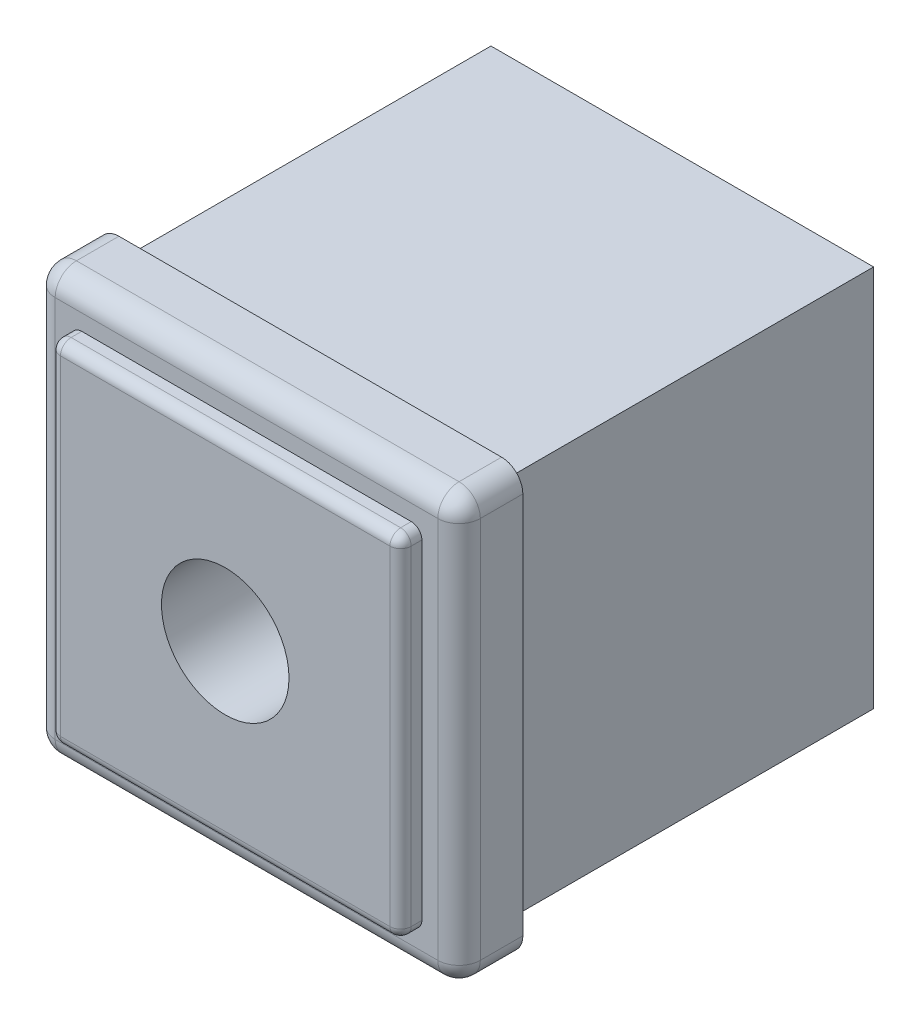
ISO-10303-21;
HEADER;
FILE_DESCRIPTION(('STEP AP214'),'2;1');
FILE_NAME('part.step','',(''),(''),'','','');
FILE_SCHEMA(('AUTOMOTIVE_DESIGN { 1 0 10303 214 1 1 1 1 }'));
ENDSEC;
DATA;
#1=APPLICATION_CONTEXT('core data for automotive mechanical design processes');
#2=APPLICATION_PROTOCOL_DEFINITION('international standard','automotive_design',2000,#1);
#3=PRODUCT_CONTEXT('',#1,'mechanical');
#4=PRODUCT('Part','Part','',(#3));
#5=PRODUCT_RELATED_PRODUCT_CATEGORY('part','',(#4));
#6=PRODUCT_DEFINITION_FORMATION('','',#4);
#7=PRODUCT_DEFINITION_CONTEXT('part definition',#1,'design');
#8=PRODUCT_DEFINITION('design','',#6,#7);
#9=PRODUCT_DEFINITION_SHAPE('','',#8);
#10=(LENGTH_UNIT() NAMED_UNIT(*) SI_UNIT(.MILLI.,.METRE.));
#11=(NAMED_UNIT(*) PLANE_ANGLE_UNIT() SI_UNIT($,.RADIAN.));
#12=(NAMED_UNIT(*) SI_UNIT($,.STERADIAN.) SOLID_ANGLE_UNIT());
#13=UNCERTAINTY_MEASURE_WITH_UNIT(LENGTH_MEASURE(1.E-05),#10,'distance_accuracy_value','');
#14=(GEOMETRIC_REPRESENTATION_CONTEXT(3) GLOBAL_UNCERTAINTY_ASSIGNED_CONTEXT((#13)) GLOBAL_UNIT_ASSIGNED_CONTEXT((#10,
#11,#12)) REPRESENTATION_CONTEXT('',''));
#15=CARTESIAN_POINT('',(0.,0.,0.));
#16=DIRECTION('',(0.,0.,1.));
#17=DIRECTION('',(1.,0.,0.));
#18=AXIS2_PLACEMENT_3D('',#15,#16,#17);
#19=CARTESIAN_POINT('',(20.,-20.,6.));
#20=DIRECTION('',(0.,0.,1.));
#21=DIRECTION('',(1.,0.,0.));
#22=AXIS2_PLACEMENT_3D('',#19,#20,#21);
#23=PLANE('',#22);
#24=DIRECTION('',(0.,1.,0.));
#25=VECTOR('',#24,1.);
#26=CARTESIAN_POINT('',(18.,18.,6.));
#27=LINE('',#26,#25);
#28=CARTESIAN_POINT('',(18.,-18.,6.));
#29=VERTEX_POINT('',#28);
#30=CARTESIAN_POINT('',(18.,18.,6.));
#31=VERTEX_POINT('',#30);
#32=EDGE_CURVE('E344',#29,#31,#27,.T.);
#33=ORIENTED_EDGE('',*,*,#32,.T.);
#34=DIRECTION('',(-1.,0.,0.));
#35=VECTOR('',#34,1.);
#36=CARTESIAN_POINT('',(-18.,18.,6.));
#37=LINE('',#36,#35);
#38=CARTESIAN_POINT('',(-18.,18.,6.));
#39=VERTEX_POINT('',#38);
#40=EDGE_CURVE('E348',#31,#39,#37,.T.);
#41=ORIENTED_EDGE('',*,*,#40,.T.);
#42=DIRECTION('',(0.,-1.,0.));
#43=VECTOR('',#42,1.);
#44=CARTESIAN_POINT('',(-18.,-18.,6.));
#45=LINE('',#44,#43);
#46=CARTESIAN_POINT('',(-18.,-18.,6.));
#47=VERTEX_POINT('',#46);
#48=EDGE_CURVE('E346',#39,#47,#45,.T.);
#49=ORIENTED_EDGE('',*,*,#48,.T.);
#50=DIRECTION('',(1.,0.,0.));
#51=VECTOR('',#50,1.);
#52=CARTESIAN_POINT('',(18.,-18.,6.));
#53=LINE('',#52,#51);
#54=EDGE_CURVE('E342',#47,#29,#53,.T.);
#55=ORIENTED_EDGE('',*,*,#54,.T.);
#56=EDGE_LOOP('',(#33,#41,#49,#55));
#57=FACE_BOUND('',#56,.T.);
#58=DIRECTION('',(1.,0.,0.));
#59=VECTOR('',#58,1.);
#60=CARTESIAN_POINT('',(-16.5,-16.5,6.));
#61=LINE('',#60,#59);
#62=CARTESIAN_POINT('',(-15.5,-16.5,6.));
#63=VERTEX_POINT('',#62);
#64=CARTESIAN_POINT('',(15.5,-16.5,6.));
#65=VERTEX_POINT('',#64);
#66=EDGE_CURVE('E266',#63,#65,#61,.T.);
#67=ORIENTED_EDGE('',*,*,#66,.F.);
#68=CARTESIAN_POINT('',(-15.5,-15.5,6.));
#69=DIRECTION('',(0.,0.,1.));
#70=DIRECTION('',(1.,0.,0.));
#71=AXIS2_PLACEMENT_3D('',#68,#69,#70);
#72=CIRCLE('',#71,1.);
#73=CARTESIAN_POINT('',(-16.5,-15.5,6.));
#74=VERTEX_POINT('',#73);
#75=EDGE_CURVE('E338',#63,#74,#72,.F.);
#76=ORIENTED_EDGE('',*,*,#75,.T.);
#77=DIRECTION('',(0.,-1.,0.));
#78=VECTOR('',#77,1.);
#79=CARTESIAN_POINT('',(-16.5,16.5,6.));
#80=LINE('',#79,#78);
#81=CARTESIAN_POINT('',(-16.5,15.5,6.));
#82=VERTEX_POINT('',#81);
#83=EDGE_CURVE('E263',#82,#74,#80,.T.);
#84=ORIENTED_EDGE('',*,*,#83,.F.);
#85=CARTESIAN_POINT('',(-15.5,15.5,6.));
#86=DIRECTION('',(0.,0.,1.));
#87=DIRECTION('',(1.,0.,0.));
#88=AXIS2_PLACEMENT_3D('',#85,#86,#87);
#89=CIRCLE('',#88,1.);
#90=CARTESIAN_POINT('',(-15.5,16.5,6.));
#91=VERTEX_POINT('',#90);
#92=EDGE_CURVE('E334',#82,#91,#89,.F.);
#93=ORIENTED_EDGE('',*,*,#92,.T.);
#94=DIRECTION('',(-1.,0.,0.));
#95=VECTOR('',#94,1.);
#96=CARTESIAN_POINT('',(-16.5,16.5,6.));
#97=LINE('',#96,#95);
#98=CARTESIAN_POINT('',(15.5,16.5,6.));
#99=VERTEX_POINT('',#98);
#100=EDGE_CURVE('E272',#99,#91,#97,.T.);
#101=ORIENTED_EDGE('',*,*,#100,.F.);
#102=CARTESIAN_POINT('',(15.5,15.5,6.));
#103=DIRECTION('',(0.,0.,1.));
#104=DIRECTION('',(1.,0.,0.));
#105=AXIS2_PLACEMENT_3D('',#102,#103,#104);
#106=CIRCLE('',#105,1.);
#107=CARTESIAN_POINT('',(16.5,15.5,6.));
#108=VERTEX_POINT('',#107);
#109=EDGE_CURVE('E336',#99,#108,#106,.F.);
#110=ORIENTED_EDGE('',*,*,#109,.T.);
#111=DIRECTION('',(0.,1.,0.));
#112=VECTOR('',#111,1.);
#113=CARTESIAN_POINT('',(16.5,16.5,6.));
#114=LINE('',#113,#112);
#115=CARTESIAN_POINT('',(16.5,-15.5,6.));
#116=VERTEX_POINT('',#115);
#117=EDGE_CURVE('E269',#116,#108,#114,.T.);
#118=ORIENTED_EDGE('',*,*,#117,.F.);
#119=CARTESIAN_POINT('',(15.5,-15.5,6.));
#120=DIRECTION('',(0.,0.,1.));
#121=DIRECTION('',(1.,0.,0.));
#122=AXIS2_PLACEMENT_3D('',#119,#120,#121);
#123=CIRCLE('',#122,1.);
#124=EDGE_CURVE('E340',#116,#65,#123,.F.);
#125=ORIENTED_EDGE('',*,*,#124,.T.);
#126=EDGE_LOOP('',(#67,#76,#84,#93,#101,#110,#118,#125));
#127=FACE_BOUND('',#126,.T.);
#128=ADVANCED_FACE('F14',(#57,#127),#23,.T.);
#129=CARTESIAN_POINT('',(-18.25,18.25,-35.));
#130=DIRECTION('',(0.,0.,1.));
#131=DIRECTION('',(1.,0.,0.));
#132=AXIS2_PLACEMENT_3D('',#129,#130,#131);
#133=PLANE('',#132);
#134=DIRECTION('',(0.,1.,0.));
#135=VECTOR('',#134,1.);
#136=CARTESIAN_POINT('',(-18.,-18.,-35.));
#137=LINE('',#136,#135);
#138=CARTESIAN_POINT('',(-18.,-18.,-35.));
#139=VERTEX_POINT('',#138);
#140=CARTESIAN_POINT('',(-18.,18.,-35.));
#141=VERTEX_POINT('',#140);
#142=EDGE_CURVE('E195',#139,#141,#137,.T.);
#143=ORIENTED_EDGE('',*,*,#142,.T.);
#144=DIRECTION('',(1.,0.,0.));
#145=VECTOR('',#144,1.);
#146=CARTESIAN_POINT('',(-18.,18.,-35.));
#147=LINE('',#146,#145);
#148=CARTESIAN_POINT('',(18.,18.,-35.));
#149=VERTEX_POINT('',#148);
#150=EDGE_CURVE('E29',#141,#149,#147,.T.);
#151=ORIENTED_EDGE('',*,*,#150,.T.);
#152=DIRECTION('',(0.,-1.,0.));
#153=VECTOR('',#152,1.);
#154=CARTESIAN_POINT('',(18.,18.,-35.));
#155=LINE('',#154,#153);
#156=CARTESIAN_POINT('',(18.,-18.,-35.));
#157=VERTEX_POINT('',#156);
#158=EDGE_CURVE('E185',#149,#157,#155,.T.);
#159=ORIENTED_EDGE('',*,*,#158,.T.);
#160=DIRECTION('',(-1.,0.,0.));
#161=VECTOR('',#160,1.);
#162=CARTESIAN_POINT('',(18.,-18.,-35.));
#163=LINE('',#162,#161);
#164=EDGE_CURVE('E190',#157,#139,#163,.T.);
#165=ORIENTED_EDGE('',*,*,#164,.T.);
#166=EDGE_LOOP('',(#143,#151,#159,#165));
#167=FACE_BOUND('',#166,.T.);
#168=CARTESIAN_POINT('',(0.,0.,-35.));
#169=DIRECTION('',(0.,0.,1.));
#170=DIRECTION('',(1.,0.,0.));
#171=AXIS2_PLACEMENT_3D('',#168,#169,#170);
#172=CIRCLE('',#171,6.);
#173=CARTESIAN_POINT('',(6.,0.,-35.));
#174=VERTEX_POINT('',#173);
#175=EDGE_CURVE('E216',#174,#174,#172,.T.);
#176=ORIENTED_EDGE('',*,*,#175,.T.);
#177=EDGE_LOOP('',(#176));
#178=FACE_BOUND('',#177,.T.);
#179=ADVANCED_FACE('F16',(#167,#178),#133,.F.);
#180=CARTESIAN_POINT('',(20.,-20.,0.));
#181=DIRECTION('',(0.,0.,1.));
#182=DIRECTION('',(1.,0.,0.));
#183=AXIS2_PLACEMENT_3D('',#180,#181,#182);
#184=PLANE('',#183);
#185=DIRECTION('',(-1.,0.,0.));
#186=VECTOR('',#185,1.);
#187=CARTESIAN_POINT('',(-20.,20.,0.));
#188=LINE('',#187,#186);
#189=CARTESIAN_POINT('',(18.,20.,0.));
#190=VERTEX_POINT('',#189);
#191=CARTESIAN_POINT('',(-18.,20.,0.));
#192=VERTEX_POINT('',#191);
#193=EDGE_CURVE('E278',#190,#192,#188,.T.);
#194=ORIENTED_EDGE('',*,*,#193,.F.);
#195=CARTESIAN_POINT('',(18.,18.,0.));
#196=DIRECTION('',(0.,0.,1.));
#197=DIRECTION('',(1.,0.,0.));
#198=AXIS2_PLACEMENT_3D('',#195,#196,#197);
#199=CIRCLE('',#198,2.);
#200=CARTESIAN_POINT('',(20.,18.,0.));
#201=VERTEX_POINT('',#200);
#202=EDGE_CURVE('E298',#190,#201,#199,.F.);
#203=ORIENTED_EDGE('',*,*,#202,.T.);
#204=DIRECTION('',(0.,1.,0.));
#205=VECTOR('',#204,1.);
#206=CARTESIAN_POINT('',(20.,20.,0.));
#207=LINE('',#206,#205);
#208=CARTESIAN_POINT('',(20.,-18.,0.));
#209=VERTEX_POINT('',#208);
#210=EDGE_CURVE('E275',#209,#201,#207,.T.);
#211=ORIENTED_EDGE('',*,*,#210,.F.);
#212=CARTESIAN_POINT('',(18.,-18.,0.));
#213=DIRECTION('',(0.,0.,1.));
#214=DIRECTION('',(1.,0.,0.));
#215=AXIS2_PLACEMENT_3D('',#212,#213,#214);
#216=CIRCLE('',#215,2.);
#217=CARTESIAN_POINT('',(18.,-20.,0.));
#218=VERTEX_POINT('',#217);
#219=EDGE_CURVE('E294',#209,#218,#216,.F.);
#220=ORIENTED_EDGE('',*,*,#219,.T.);
#221=DIRECTION('',(1.,0.,0.));
#222=VECTOR('',#221,1.);
#223=CARTESIAN_POINT('',(-20.,-20.,0.));
#224=LINE('',#223,#222);
#225=CARTESIAN_POINT('',(-18.,-20.,0.));
#226=VERTEX_POINT('',#225);
#227=EDGE_CURVE('E284',#226,#218,#224,.T.);
#228=ORIENTED_EDGE('',*,*,#227,.F.);
#229=CARTESIAN_POINT('',(-18.,-18.,0.));
#230=DIRECTION('',(0.,0.,1.));
#231=DIRECTION('',(1.,0.,0.));
#232=AXIS2_PLACEMENT_3D('',#229,#230,#231);
#233=CIRCLE('',#232,2.);
#234=CARTESIAN_POINT('',(-20.,-18.,0.));
#235=VERTEX_POINT('',#234);
#236=EDGE_CURVE('E292',#226,#235,#233,.F.);
#237=ORIENTED_EDGE('',*,*,#236,.T.);
#238=DIRECTION('',(0.,-1.,0.));
#239=VECTOR('',#238,1.);
#240=CARTESIAN_POINT('',(-20.,20.,0.));
#241=LINE('',#240,#239);
#242=CARTESIAN_POINT('',(-20.,18.,0.));
#243=VERTEX_POINT('',#242);
#244=EDGE_CURVE('E281',#243,#235,#241,.T.);
#245=ORIENTED_EDGE('',*,*,#244,.F.);
#246=CARTESIAN_POINT('',(-18.,18.,0.));
#247=DIRECTION('',(0.,0.,1.));
#248=DIRECTION('',(1.,0.,0.));
#249=AXIS2_PLACEMENT_3D('',#246,#247,#248);
#250=CIRCLE('',#249,2.);
#251=EDGE_CURVE('E296',#243,#192,#250,.F.);
#252=ORIENTED_EDGE('',*,*,#251,.T.);
#253=EDGE_LOOP('',(#194,#203,#211,#220,#228,#237,#245,#252));
#254=FACE_BOUND('',#253,.T.);
#255=DIRECTION('',(1.,0.,0.));
#256=VECTOR('',#255,1.);
#257=CARTESIAN_POINT('',(-18.,18.,0.));
#258=LINE('',#257,#256);
#259=CARTESIAN_POINT('',(-18.,18.,0.));
#260=VERTEX_POINT('',#259);
#261=CARTESIAN_POINT('',(18.,18.,0.));
#262=VERTEX_POINT('',#261);
#263=EDGE_CURVE('E178',#260,#262,#258,.T.);
#264=ORIENTED_EDGE('',*,*,#263,.F.);
#265=DIRECTION('',(0.,1.,0.));
#266=VECTOR('',#265,1.);
#267=CARTESIAN_POINT('',(-18.,-18.,0.));
#268=LINE('',#267,#266);
#269=CARTESIAN_POINT('',(-18.,-18.,0.));
#270=VERTEX_POINT('',#269);
#271=EDGE_CURVE('E196',#270,#260,#268,.T.);
#272=ORIENTED_EDGE('',*,*,#271,.F.);
#273=DIRECTION('',(-1.,0.,0.));
#274=VECTOR('',#273,1.);
#275=CARTESIAN_POINT('',(18.,-18.,0.));
#276=LINE('',#275,#274);
#277=CARTESIAN_POINT('',(18.,-18.,0.));
#278=VERTEX_POINT('',#277);
#279=EDGE_CURVE('E199',#278,#270,#276,.T.);
#280=ORIENTED_EDGE('',*,*,#279,.F.);
#281=DIRECTION('',(0.,-1.,0.));
#282=VECTOR('',#281,1.);
#283=CARTESIAN_POINT('',(18.,18.,0.));
#284=LINE('',#283,#282);
#285=EDGE_CURVE('E206',#262,#278,#284,.T.);
#286=ORIENTED_EDGE('',*,*,#285,.F.);
#287=EDGE_LOOP('',(#264,#272,#280,#286));
#288=FACE_BOUND('',#287,.T.);
#289=ADVANCED_FACE('F462',(#254,#288),#184,.F.);
#290=CARTESIAN_POINT('',(20.,20.,6.));
#291=DIRECTION('',(-1.,0.,0.));
#292=DIRECTION('',(0.,-1.,0.));
#293=AXIS2_PLACEMENT_3D('',#290,#291,#292);
#294=PLANE('',#293);
#295=DIRECTION('',(0.,0.,-1.));
#296=VECTOR('',#295,1.);
#297=CARTESIAN_POINT('',(20.,18.,6.));
#298=LINE('',#297,#296);
#299=CARTESIAN_POINT('',(20.,18.,4.));
#300=VERTEX_POINT('',#299);
#301=EDGE_CURVE('E302',#201,#300,#298,.F.);
#302=ORIENTED_EDGE('',*,*,#301,.T.);
#303=DIRECTION('',(0.,1.,0.));
#304=VECTOR('',#303,1.);
#305=CARTESIAN_POINT('',(20.,-18.,4.));
#306=LINE('',#305,#304);
#307=CARTESIAN_POINT('',(20.,-18.,4.));
#308=VERTEX_POINT('',#307);
#309=EDGE_CURVE('E360',#300,#308,#306,.F.);
#310=ORIENTED_EDGE('',*,*,#309,.T.);
#311=DIRECTION('',(0.,0.,-1.));
#312=VECTOR('',#311,1.);
#313=CARTESIAN_POINT('',(20.,-18.,6.));
#314=LINE('',#313,#312);
#315=EDGE_CURVE('E300',#308,#209,#314,.T.);
#316=ORIENTED_EDGE('',*,*,#315,.T.);
#317=ORIENTED_EDGE('',*,*,#210,.T.);
#318=EDGE_LOOP('',(#302,#310,#316,#317));
#319=FACE_BOUND('',#318,.T.);
#320=ADVANCED_FACE('F476',(#319),#294,.F.);
#321=CARTESIAN_POINT('',(-20.,20.,6.));
#322=DIRECTION('',(0.,-1.,0.));
#323=DIRECTION('',(0.,0.,-1.));
#324=AXIS2_PLACEMENT_3D('',#321,#322,#323);
#325=PLANE('',#324);
#326=DIRECTION('',(0.,0.,-1.));
#327=VECTOR('',#326,1.);
#328=CARTESIAN_POINT('',(-18.,20.,6.));
#329=LINE('',#328,#327);
#330=CARTESIAN_POINT('',(-18.,20.,4.));
#331=VERTEX_POINT('',#330);
#332=EDGE_CURVE('E287',#192,#331,#329,.F.);
#333=ORIENTED_EDGE('',*,*,#332,.T.);
#334=DIRECTION('',(-1.,0.,0.));
#335=VECTOR('',#334,1.);
#336=CARTESIAN_POINT('',(18.,20.,4.));
#337=LINE('',#336,#335);
#338=CARTESIAN_POINT('',(18.,20.,4.));
#339=VERTEX_POINT('',#338);
#340=EDGE_CURVE('E351',#331,#339,#337,.F.);
#341=ORIENTED_EDGE('',*,*,#340,.T.);
#342=DIRECTION('',(0.,0.,-1.));
#343=VECTOR('',#342,1.);
#344=CARTESIAN_POINT('',(18.,20.,6.));
#345=LINE('',#344,#343);
#346=EDGE_CURVE('E290',#339,#190,#345,.T.);
#347=ORIENTED_EDGE('',*,*,#346,.T.);
#348=ORIENTED_EDGE('',*,*,#193,.T.);
#349=EDGE_LOOP('',(#333,#341,#347,#348));
#350=FACE_BOUND('',#349,.T.);
#351=ADVANCED_FACE('F473',(#350),#325,.F.);
#352=CARTESIAN_POINT('',(-20.,20.,6.));
#353=DIRECTION('',(1.,0.,0.));
#354=DIRECTION('',(0.,0.,-1.));
#355=AXIS2_PLACEMENT_3D('',#352,#353,#354);
#356=PLANE('',#355);
#357=DIRECTION('',(0.,0.,-1.));
#358=VECTOR('',#357,1.);
#359=CARTESIAN_POINT('',(-20.,-18.,6.));
#360=LINE('',#359,#358);
#361=CARTESIAN_POINT('',(-20.,-18.,4.));
#362=VERTEX_POINT('',#361);
#363=EDGE_CURVE('E305',#235,#362,#360,.F.);
#364=ORIENTED_EDGE('',*,*,#363,.T.);
#365=DIRECTION('',(0.,-1.,0.));
#366=VECTOR('',#365,1.);
#367=CARTESIAN_POINT('',(-20.,18.,4.));
#368=LINE('',#367,#366);
#369=CARTESIAN_POINT('',(-20.,18.,4.));
#370=VERTEX_POINT('',#369);
#371=EDGE_CURVE('E358',#362,#370,#368,.F.);
#372=ORIENTED_EDGE('',*,*,#371,.T.);
#373=DIRECTION('',(0.,0.,-1.));
#374=VECTOR('',#373,1.);
#375=CARTESIAN_POINT('',(-20.,18.,6.));
#376=LINE('',#375,#374);
#377=EDGE_CURVE('E308',#370,#243,#376,.T.);
#378=ORIENTED_EDGE('',*,*,#377,.T.);
#379=ORIENTED_EDGE('',*,*,#244,.T.);
#380=EDGE_LOOP('',(#364,#372,#378,#379));
#381=FACE_BOUND('',#380,.T.);
#382=ADVANCED_FACE('F469',(#381),#356,.F.);
#383=CARTESIAN_POINT('',(-20.,-20.,6.));
#384=DIRECTION('',(0.,1.,0.));
#385=DIRECTION('',(0.,0.,1.));
#386=AXIS2_PLACEMENT_3D('',#383,#384,#385);
#387=PLANE('',#386);
#388=DIRECTION('',(0.,0.,-1.));
#389=VECTOR('',#388,1.);
#390=CARTESIAN_POINT('',(18.,-20.,6.));
#391=LINE('',#390,#389);
#392=CARTESIAN_POINT('',(18.,-20.,4.));
#393=VERTEX_POINT('',#392);
#394=EDGE_CURVE('E312',#218,#393,#391,.F.);
#395=ORIENTED_EDGE('',*,*,#394,.T.);
#396=DIRECTION('',(1.,0.,0.));
#397=VECTOR('',#396,1.);
#398=CARTESIAN_POINT('',(-18.,-20.,4.));
#399=LINE('',#398,#397);
#400=CARTESIAN_POINT('',(-18.,-20.,4.));
#401=VERTEX_POINT('',#400);
#402=EDGE_CURVE('E366',#393,#401,#399,.F.);
#403=ORIENTED_EDGE('',*,*,#402,.T.);
#404=DIRECTION('',(0.,0.,-1.));
#405=VECTOR('',#404,1.);
#406=CARTESIAN_POINT('',(-18.,-20.,6.));
#407=LINE('',#406,#405);
#408=EDGE_CURVE('E310',#401,#226,#407,.T.);
#409=ORIENTED_EDGE('',*,*,#408,.T.);
#410=ORIENTED_EDGE('',*,*,#227,.T.);
#411=EDGE_LOOP('',(#395,#403,#409,#410));
#412=FACE_BOUND('',#411,.T.);
#413=ADVANCED_FACE('F466',(#412),#387,.F.);
#414=CARTESIAN_POINT('',(-16.5,16.5,8.));
#415=DIRECTION('',(1.,0.,0.));
#416=DIRECTION('',(0.,1.,0.));
#417=AXIS2_PLACEMENT_3D('',#414,#415,#416);
#418=PLANE('',#417);
#419=DIRECTION('',(0.,0.,-1.));
#420=VECTOR('',#419,1.);
#421=CARTESIAN_POINT('',(-16.5,-15.5,8.));
#422=LINE('',#421,#420);
#423=CARTESIAN_POINT('',(-16.5,-15.5,7.));
#424=VERTEX_POINT('',#423);
#425=EDGE_CURVE('E315',#74,#424,#422,.F.);
#426=ORIENTED_EDGE('',*,*,#425,.T.);
#427=DIRECTION('',(0.,-1.,0.));
#428=VECTOR('',#427,1.);
#429=CARTESIAN_POINT('',(-16.5,15.5,7.));
#430=LINE('',#429,#428);
#431=CARTESIAN_POINT('',(-16.5,15.5,7.));
#432=VERTEX_POINT('',#431);
#433=EDGE_CURVE('E377',#424,#432,#430,.F.);
#434=ORIENTED_EDGE('',*,*,#433,.T.);
#435=DIRECTION('',(0.,0.,-1.));
#436=VECTOR('',#435,1.);
#437=CARTESIAN_POINT('',(-16.5,15.5,8.));
#438=LINE('',#437,#436);
#439=EDGE_CURVE('E318',#432,#82,#438,.T.);
#440=ORIENTED_EDGE('',*,*,#439,.T.);
#441=ORIENTED_EDGE('',*,*,#83,.T.);
#442=EDGE_LOOP('',(#426,#434,#440,#441));
#443=FACE_BOUND('',#442,.T.);
#444=ADVANCED_FACE('F418',(#443),#418,.F.);
#445=CARTESIAN_POINT('',(-16.5,-16.5,8.));
#446=DIRECTION('',(0.,1.,0.));
#447=DIRECTION('',(-1.,0.,0.));
#448=AXIS2_PLACEMENT_3D('',#445,#446,#447);
#449=PLANE('',#448);
#450=DIRECTION('',(0.,0.,-1.));
#451=VECTOR('',#450,1.);
#452=CARTESIAN_POINT('',(15.5,-16.5,8.));
#453=LINE('',#452,#451);
#454=CARTESIAN_POINT('',(15.5,-16.5,7.));
#455=VERTEX_POINT('',#454);
#456=EDGE_CURVE('E329',#65,#455,#453,.F.);
#457=ORIENTED_EDGE('',*,*,#456,.T.);
#458=DIRECTION('',(1.,0.,0.));
#459=VECTOR('',#458,1.);
#460=CARTESIAN_POINT('',(-15.5,-16.5,7.));
#461=LINE('',#460,#459);
#462=CARTESIAN_POINT('',(-15.5,-16.5,7.));
#463=VERTEX_POINT('',#462);
#464=EDGE_CURVE('E384',#455,#463,#461,.F.);
#465=ORIENTED_EDGE('',*,*,#464,.T.);
#466=DIRECTION('',(0.,0.,-1.));
#467=VECTOR('',#466,1.);
#468=CARTESIAN_POINT('',(-15.5,-16.5,8.));
#469=LINE('',#468,#467);
#470=EDGE_CURVE('E332',#463,#63,#469,.T.);
#471=ORIENTED_EDGE('',*,*,#470,.T.);
#472=ORIENTED_EDGE('',*,*,#66,.T.);
#473=EDGE_LOOP('',(#457,#465,#471,#472));
#474=FACE_BOUND('',#473,.T.);
#475=ADVANCED_FACE('F399',(#474),#449,.F.);
#476=CARTESIAN_POINT('',(16.5,16.5,8.));
#477=DIRECTION('',(-1.,0.,0.));
#478=DIRECTION('',(0.,0.,1.));
#479=AXIS2_PLACEMENT_3D('',#476,#477,#478);
#480=PLANE('',#479);
#481=DIRECTION('',(0.,0.,-1.));
#482=VECTOR('',#481,1.);
#483=CARTESIAN_POINT('',(16.5,15.5,8.));
#484=LINE('',#483,#482);
#485=CARTESIAN_POINT('',(16.5,15.5,7.));
#486=VERTEX_POINT('',#485);
#487=EDGE_CURVE('E327',#108,#486,#484,.F.);
#488=ORIENTED_EDGE('',*,*,#487,.T.);
#489=DIRECTION('',(0.,1.,0.));
#490=VECTOR('',#489,1.);
#491=CARTESIAN_POINT('',(16.5,-15.5,7.));
#492=LINE('',#491,#490);
#493=CARTESIAN_POINT('',(16.5,-15.5,7.));
#494=VERTEX_POINT('',#493);
#495=EDGE_CURVE('E9',#486,#494,#492,.F.);
#496=ORIENTED_EDGE('',*,*,#495,.T.);
#497=DIRECTION('',(0.,0.,-1.));
#498=VECTOR('',#497,1.);
#499=CARTESIAN_POINT('',(16.5,-15.5,8.));
#500=LINE('',#499,#498);
#501=EDGE_CURVE('E325',#494,#116,#500,.T.);
#502=ORIENTED_EDGE('',*,*,#501,.T.);
#503=ORIENTED_EDGE('',*,*,#117,.T.);
#504=EDGE_LOOP('',(#488,#496,#502,#503));
#505=FACE_BOUND('',#504,.T.);
#506=ADVANCED_FACE('F449',(#505),#480,.F.);
#507=CARTESIAN_POINT('',(-16.5,16.5,8.));
#508=DIRECTION('',(0.,-1.,0.));
#509=DIRECTION('',(1.,0.,0.));
#510=AXIS2_PLACEMENT_3D('',#507,#508,#509);
#511=PLANE('',#510);
#512=DIRECTION('',(0.,0.,-1.));
#513=VECTOR('',#512,1.);
#514=CARTESIAN_POINT('',(-15.5,16.5,8.));
#515=LINE('',#514,#513);
#516=CARTESIAN_POINT('',(-15.5,16.5,7.));
#517=VERTEX_POINT('',#516);
#518=EDGE_CURVE('E322',#91,#517,#515,.F.);
#519=ORIENTED_EDGE('',*,*,#518,.T.);
#520=DIRECTION('',(-1.,0.,0.));
#521=VECTOR('',#520,1.);
#522=CARTESIAN_POINT('',(15.5,16.5,7.));
#523=LINE('',#522,#521);
#524=CARTESIAN_POINT('',(15.5,16.5,7.));
#525=VERTEX_POINT('',#524);
#526=EDGE_CURVE('E386',#517,#525,#523,.F.);
#527=ORIENTED_EDGE('',*,*,#526,.T.);
#528=DIRECTION('',(0.,0.,-1.));
#529=VECTOR('',#528,1.);
#530=CARTESIAN_POINT('',(15.5,16.5,8.));
#531=LINE('',#530,#529);
#532=EDGE_CURVE('E320',#525,#99,#531,.T.);
#533=ORIENTED_EDGE('',*,*,#532,.T.);
#534=ORIENTED_EDGE('',*,*,#100,.T.);
#535=EDGE_LOOP('',(#519,#527,#533,#534));
#536=FACE_BOUND('',#535,.T.);
#537=ADVANCED_FACE('F435',(#536),#511,.F.);
#538=CARTESIAN_POINT('',(-16.5,-16.5,8.));
#539=DIRECTION('',(0.,0.,1.));
#540=DIRECTION('',(1.,0.,0.));
#541=AXIS2_PLACEMENT_3D('',#538,#539,#540);
#542=PLANE('',#541);
#543=CARTESIAN_POINT('',(0.,0.,8.));
#544=DIRECTION('',(0.,0.,1.));
#545=DIRECTION('',(1.,0.,0.));
#546=AXIS2_PLACEMENT_3D('',#543,#544,#545);
#547=CIRCLE('',#546,6.);
#548=CARTESIAN_POINT('',(6.,0.,8.));
#549=VERTEX_POINT('',#548);
#550=EDGE_CURVE('E181',#549,#549,#547,.T.);
#551=ORIENTED_EDGE('',*,*,#550,.F.);
#552=EDGE_LOOP('',(#551));
#553=FACE_BOUND('',#552,.T.);
#554=DIRECTION('',(-1.,0.,0.));
#555=VECTOR('',#554,1.);
#556=CARTESIAN_POINT('',(-15.5,15.5,8.));
#557=LINE('',#556,#555);
#558=CARTESIAN_POINT('',(15.5,15.5,8.));
#559=VERTEX_POINT('',#558);
#560=CARTESIAN_POINT('',(-15.5,15.5,8.));
#561=VERTEX_POINT('',#560);
#562=EDGE_CURVE('E370',#559,#561,#557,.T.);
#563=ORIENTED_EDGE('',*,*,#562,.T.);
#564=DIRECTION('',(0.,-1.,0.));
#565=VECTOR('',#564,1.);
#566=CARTESIAN_POINT('',(-15.5,-15.5,8.));
#567=LINE('',#566,#565);
#568=CARTESIAN_POINT('',(-15.5,-15.5,8.));
#569=VERTEX_POINT('',#568);
#570=EDGE_CURVE('E374',#561,#569,#567,.T.);
#571=ORIENTED_EDGE('',*,*,#570,.T.);
#572=DIRECTION('',(1.,0.,0.));
#573=VECTOR('',#572,1.);
#574=CARTESIAN_POINT('',(15.5,-15.5,8.));
#575=LINE('',#574,#573);
#576=CARTESIAN_POINT('',(15.5,-15.5,8.));
#577=VERTEX_POINT('',#576);
#578=EDGE_CURVE('E372',#569,#577,#575,.T.);
#579=ORIENTED_EDGE('',*,*,#578,.T.);
#580=DIRECTION('',(0.,1.,0.));
#581=VECTOR('',#580,1.);
#582=CARTESIAN_POINT('',(15.5,15.5,8.));
#583=LINE('',#582,#581);
#584=EDGE_CURVE('E368',#577,#559,#583,.T.);
#585=ORIENTED_EDGE('',*,*,#584,.T.);
#586=EDGE_LOOP('',(#563,#571,#579,#585));
#587=FACE_BOUND('',#586,.T.);
#588=ADVANCED_FACE('F554',(#553,#587),#542,.T.);
#589=CARTESIAN_POINT('',(18.,18.,6.));
#590=DIRECTION('',(0.,0.,-1.));
#591=DIRECTION('',(-1.,0.,0.));
#592=AXIS2_PLACEMENT_3D('',#589,#590,#591);
#593=CYLINDRICAL_SURFACE('',#592,2.);
#594=ORIENTED_EDGE('',*,*,#346,.F.);
#595=CARTESIAN_POINT('',(18.,18.,4.));
#596=DIRECTION('',(0.,0.,-1.));
#597=DIRECTION('',(-1.,0.,0.));
#598=AXIS2_PLACEMENT_3D('',#595,#596,#597);
#599=CIRCLE('',#598,2.);
#600=EDGE_CURVE('E356',#339,#300,#599,.T.);
#601=ORIENTED_EDGE('',*,*,#600,.T.);
#602=ORIENTED_EDGE('',*,*,#301,.F.);
#603=ORIENTED_EDGE('',*,*,#202,.F.);
#604=EDGE_LOOP('',(#594,#601,#602,#603));
#605=FACE_BOUND('',#604,.T.);
#606=ADVANCED_FACE('F526',(#605),#593,.T.);
#607=CARTESIAN_POINT('',(-18.,18.,6.));
#608=DIRECTION('',(0.,0.,-1.));
#609=DIRECTION('',(-1.,0.,0.));
#610=AXIS2_PLACEMENT_3D('',#607,#608,#609);
#611=CYLINDRICAL_SURFACE('',#610,2.);
#612=ORIENTED_EDGE('',*,*,#377,.F.);
#613=CARTESIAN_POINT('',(-18.,18.,4.));
#614=DIRECTION('',(0.,0.,-1.));
#615=DIRECTION('',(-1.,0.,0.));
#616=AXIS2_PLACEMENT_3D('',#613,#614,#615);
#617=CIRCLE('',#616,2.);
#618=EDGE_CURVE('E354',#370,#331,#617,.T.);
#619=ORIENTED_EDGE('',*,*,#618,.T.);
#620=ORIENTED_EDGE('',*,*,#332,.F.);
#621=ORIENTED_EDGE('',*,*,#251,.F.);
#622=EDGE_LOOP('',(#612,#619,#620,#621));
#623=FACE_BOUND('',#622,.T.);
#624=ADVANCED_FACE('F545',(#623),#611,.T.);
#625=CARTESIAN_POINT('',(18.,-18.,6.));
#626=DIRECTION('',(0.,0.,-1.));
#627=DIRECTION('',(-1.,0.,0.));
#628=AXIS2_PLACEMENT_3D('',#625,#626,#627);
#629=CYLINDRICAL_SURFACE('',#628,2.);
#630=ORIENTED_EDGE('',*,*,#315,.F.);
#631=CARTESIAN_POINT('',(18.,-18.,4.));
#632=DIRECTION('',(0.,0.,-1.));
#633=DIRECTION('',(-1.,0.,0.));
#634=AXIS2_PLACEMENT_3D('',#631,#632,#633);
#635=CIRCLE('',#634,2.);
#636=EDGE_CURVE('E364',#308,#393,#635,.T.);
#637=ORIENTED_EDGE('',*,*,#636,.T.);
#638=ORIENTED_EDGE('',*,*,#394,.F.);
#639=ORIENTED_EDGE('',*,*,#219,.F.);
#640=EDGE_LOOP('',(#630,#637,#638,#639));
#641=FACE_BOUND('',#640,.T.);
#642=ADVANCED_FACE('F517',(#641),#629,.T.);
#643=CARTESIAN_POINT('',(-18.,-18.,6.));
#644=DIRECTION('',(0.,0.,-1.));
#645=DIRECTION('',(-1.,0.,0.));
#646=AXIS2_PLACEMENT_3D('',#643,#644,#645);
#647=CYLINDRICAL_SURFACE('',#646,2.);
#648=ORIENTED_EDGE('',*,*,#408,.F.);
#649=CARTESIAN_POINT('',(-18.,-18.,4.));
#650=DIRECTION('',(0.,0.,-1.));
#651=DIRECTION('',(-1.,0.,0.));
#652=AXIS2_PLACEMENT_3D('',#649,#650,#651);
#653=CIRCLE('',#652,2.);
#654=EDGE_CURVE('E362',#401,#362,#653,.T.);
#655=ORIENTED_EDGE('',*,*,#654,.T.);
#656=ORIENTED_EDGE('',*,*,#363,.F.);
#657=ORIENTED_EDGE('',*,*,#236,.F.);
#658=EDGE_LOOP('',(#648,#655,#656,#657));
#659=FACE_BOUND('',#658,.T.);
#660=ADVANCED_FACE('F541',(#659),#647,.T.);
#661=CARTESIAN_POINT('',(-15.5,15.5,8.));
#662=DIRECTION('',(0.,0.,-1.));
#663=DIRECTION('',(-1.,0.,0.));
#664=AXIS2_PLACEMENT_3D('',#661,#662,#663);
#665=CYLINDRICAL_SURFACE('',#664,1.);
#666=ORIENTED_EDGE('',*,*,#439,.F.);
#667=CARTESIAN_POINT('',(-15.5,15.5,7.));
#668=DIRECTION('',(0.,0.,-1.));
#669=DIRECTION('',(-1.,0.,0.));
#670=AXIS2_PLACEMENT_3D('',#667,#668,#669);
#671=CIRCLE('',#670,1.);
#672=EDGE_CURVE('E382',#432,#517,#671,.T.);
#673=ORIENTED_EDGE('',*,*,#672,.T.);
#674=ORIENTED_EDGE('',*,*,#518,.F.);
#675=ORIENTED_EDGE('',*,*,#92,.F.);
#676=EDGE_LOOP('',(#666,#673,#674,#675));
#677=FACE_BOUND('',#676,.T.);
#678=ADVANCED_FACE('F431',(#677),#665,.T.);
#679=CARTESIAN_POINT('',(15.5,15.5,8.));
#680=DIRECTION('',(0.,0.,-1.));
#681=DIRECTION('',(-1.,0.,0.));
#682=AXIS2_PLACEMENT_3D('',#679,#680,#681);
#683=CYLINDRICAL_SURFACE('',#682,1.);
#684=ORIENTED_EDGE('',*,*,#532,.F.);
#685=CARTESIAN_POINT('',(15.5,15.5,7.));
#686=DIRECTION('',(0.,0.,-1.));
#687=DIRECTION('',(-1.,0.,0.));
#688=AXIS2_PLACEMENT_3D('',#685,#686,#687);
#689=CIRCLE('',#688,1.);
#690=EDGE_CURVE('E22',#525,#486,#689,.T.);
#691=ORIENTED_EDGE('',*,*,#690,.T.);
#692=ORIENTED_EDGE('',*,*,#487,.F.);
#693=ORIENTED_EDGE('',*,*,#109,.F.);
#694=EDGE_LOOP('',(#684,#691,#692,#693));
#695=FACE_BOUND('',#694,.T.);
#696=ADVANCED_FACE('F452',(#695),#683,.T.);
#697=CARTESIAN_POINT('',(-15.5,-15.5,8.));
#698=DIRECTION('',(0.,0.,-1.));
#699=DIRECTION('',(-1.,0.,0.));
#700=AXIS2_PLACEMENT_3D('',#697,#698,#699);
#701=CYLINDRICAL_SURFACE('',#700,1.);
#702=ORIENTED_EDGE('',*,*,#470,.F.);
#703=CARTESIAN_POINT('',(-15.5,-15.5,7.));
#704=DIRECTION('',(0.,0.,-1.));
#705=DIRECTION('',(-1.,0.,0.));
#706=AXIS2_PLACEMENT_3D('',#703,#704,#705);
#707=CIRCLE('',#706,1.);
#708=EDGE_CURVE('E380',#463,#424,#707,.T.);
#709=ORIENTED_EDGE('',*,*,#708,.T.);
#710=ORIENTED_EDGE('',*,*,#425,.F.);
#711=ORIENTED_EDGE('',*,*,#75,.F.);
#712=EDGE_LOOP('',(#702,#709,#710,#711));
#713=FACE_BOUND('',#712,.T.);
#714=ADVANCED_FACE('F414',(#713),#701,.T.);
#715=CARTESIAN_POINT('',(15.5,-15.5,8.));
#716=DIRECTION('',(0.,0.,-1.));
#717=DIRECTION('',(-1.,0.,0.));
#718=AXIS2_PLACEMENT_3D('',#715,#716,#717);
#719=CYLINDRICAL_SURFACE('',#718,1.);
#720=ORIENTED_EDGE('',*,*,#501,.F.);
#721=CARTESIAN_POINT('',(15.5,-15.5,7.));
#722=DIRECTION('',(0.,0.,-1.));
#723=DIRECTION('',(-1.,0.,0.));
#724=AXIS2_PLACEMENT_3D('',#721,#722,#723);
#725=CIRCLE('',#724,1.);
#726=EDGE_CURVE('E388',#494,#455,#725,.T.);
#727=ORIENTED_EDGE('',*,*,#726,.T.);
#728=ORIENTED_EDGE('',*,*,#456,.F.);
#729=ORIENTED_EDGE('',*,*,#124,.F.);
#730=EDGE_LOOP('',(#720,#727,#728,#729));
#731=FACE_BOUND('',#730,.T.);
#732=ADVANCED_FACE('F393',(#731),#719,.T.);
#733=CARTESIAN_POINT('',(20.,-18.,4.));
#734=DIRECTION('',(-1.,0.,0.));
#735=DIRECTION('',(0.,0.,1.));
#736=AXIS2_PLACEMENT_3D('',#733,#734,#735);
#737=CYLINDRICAL_SURFACE('',#736,2.);
#738=CARTESIAN_POINT('',(-18.,-18.,4.));
#739=DIRECTION('',(-1.,0.,0.));
#740=DIRECTION('',(0.,0.,1.));
#741=AXIS2_PLACEMENT_3D('',#738,#739,#740);
#742=CIRCLE('',#741,2.);
#743=EDGE_CURVE('E257',#401,#47,#742,.T.);
#744=ORIENTED_EDGE('',*,*,#743,.F.);
#745=ORIENTED_EDGE('',*,*,#402,.F.);
#746=CARTESIAN_POINT('',(18.,-18.,4.));
#747=DIRECTION('',(1.,0.,0.));
#748=DIRECTION('',(0.,0.,-1.));
#749=AXIS2_PLACEMENT_3D('',#746,#747,#748);
#750=CIRCLE('',#749,2.);
#751=EDGE_CURVE('E260',#29,#393,#750,.T.);
#752=ORIENTED_EDGE('',*,*,#751,.F.);
#753=ORIENTED_EDGE('',*,*,#54,.F.);
#754=EDGE_LOOP('',(#744,#745,#752,#753));
#755=FACE_BOUND('',#754,.T.);
#756=ADVANCED_FACE('F511',(#755),#737,.T.);
#757=CARTESIAN_POINT('',(18.,-18.,4.));
#758=DIRECTION('',(0.,0.,1.));
#759=DIRECTION('',(1.,0.,0.));
#760=AXIS2_PLACEMENT_3D('',#757,#758,#759);
#761=SPHERICAL_SURFACE('',#760,2.);
#762=ORIENTED_EDGE('',*,*,#751,.T.);
#763=ORIENTED_EDGE('',*,*,#636,.F.);
#764=CARTESIAN_POINT('',(18.,-18.,4.));
#765=DIRECTION('',(0.,1.,0.));
#766=DIRECTION('',(0.,0.,1.));
#767=AXIS2_PLACEMENT_3D('',#764,#765,#766);
#768=CIRCLE('',#767,2.);
#769=EDGE_CURVE('E254',#29,#308,#768,.T.);
#770=ORIENTED_EDGE('',*,*,#769,.F.);
#771=EDGE_LOOP('',(#762,#763,#770));
#772=FACE_BOUND('',#771,.T.);
#773=ADVANCED_FACE('F514',(#772),#761,.T.);
#774=CARTESIAN_POINT('',(-18.,-18.,4.));
#775=DIRECTION('',(0.,0.,1.));
#776=DIRECTION('',(1.,0.,0.));
#777=AXIS2_PLACEMENT_3D('',#774,#775,#776);
#778=SPHERICAL_SURFACE('',#777,2.);
#779=ORIENTED_EDGE('',*,*,#654,.F.);
#780=ORIENTED_EDGE('',*,*,#743,.T.);
#781=CARTESIAN_POINT('',(-18.,-18.,4.));
#782=DIRECTION('',(0.,1.,0.));
#783=DIRECTION('',(-1.,0.,0.));
#784=AXIS2_PLACEMENT_3D('',#781,#782,#783);
#785=CIRCLE('',#784,2.);
#786=EDGE_CURVE('E251',#362,#47,#785,.T.);
#787=ORIENTED_EDGE('',*,*,#786,.F.);
#788=EDGE_LOOP('',(#779,#780,#787));
#789=FACE_BOUND('',#788,.T.);
#790=ADVANCED_FACE('F538',(#789),#778,.T.);
#791=CARTESIAN_POINT('',(18.,-20.,4.));
#792=DIRECTION('',(0.,-1.,0.));
#793=DIRECTION('',(1.,0.,0.));
#794=AXIS2_PLACEMENT_3D('',#791,#792,#793);
#795=CYLINDRICAL_SURFACE('',#794,2.);
#796=ORIENTED_EDGE('',*,*,#769,.T.);
#797=ORIENTED_EDGE('',*,*,#309,.F.);
#798=CARTESIAN_POINT('',(18.,18.,4.));
#799=DIRECTION('',(0.,1.,0.));
#800=DIRECTION('',(0.,0.,1.));
#801=AXIS2_PLACEMENT_3D('',#798,#799,#800);
#802=CIRCLE('',#801,2.);
#803=EDGE_CURVE('E248',#31,#300,#802,.T.);
#804=ORIENTED_EDGE('',*,*,#803,.F.);
#805=ORIENTED_EDGE('',*,*,#32,.F.);
#806=EDGE_LOOP('',(#796,#797,#804,#805));
#807=FACE_BOUND('',#806,.T.);
#808=ADVANCED_FACE('F493',(#807),#795,.T.);
#809=CARTESIAN_POINT('',(-18.,-20.,4.));
#810=DIRECTION('',(0.,1.,0.));
#811=DIRECTION('',(0.,0.,1.));
#812=AXIS2_PLACEMENT_3D('',#809,#810,#811);
#813=CYLINDRICAL_SURFACE('',#812,2.);
#814=ORIENTED_EDGE('',*,*,#786,.T.);
#815=ORIENTED_EDGE('',*,*,#48,.F.);
#816=CARTESIAN_POINT('',(-18.,18.,4.));
#817=DIRECTION('',(0.,1.,0.));
#818=DIRECTION('',(0.,0.,1.));
#819=AXIS2_PLACEMENT_3D('',#816,#817,#818);
#820=CIRCLE('',#819,2.);
#821=EDGE_CURVE('E245',#370,#39,#820,.T.);
#822=ORIENTED_EDGE('',*,*,#821,.F.);
#823=ORIENTED_EDGE('',*,*,#371,.F.);
#824=EDGE_LOOP('',(#814,#815,#822,#823));
#825=FACE_BOUND('',#824,.T.);
#826=ADVANCED_FACE('F534',(#825),#813,.T.);
#827=CARTESIAN_POINT('',(18.,18.,4.));
#828=DIRECTION('',(0.,0.,1.));
#829=DIRECTION('',(1.,0.,0.));
#830=AXIS2_PLACEMENT_3D('',#827,#828,#829);
#831=SPHERICAL_SURFACE('',#830,2.);
#832=ORIENTED_EDGE('',*,*,#803,.T.);
#833=ORIENTED_EDGE('',*,*,#600,.F.);
#834=CARTESIAN_POINT('',(18.,18.,4.));
#835=DIRECTION('',(-1.,0.,0.));
#836=DIRECTION('',(0.,0.,1.));
#837=AXIS2_PLACEMENT_3D('',#834,#835,#836);
#838=CIRCLE('',#837,2.);
#839=EDGE_CURVE('E243',#31,#339,#838,.T.);
#840=ORIENTED_EDGE('',*,*,#839,.F.);
#841=EDGE_LOOP('',(#832,#833,#840));
#842=FACE_BOUND('',#841,.T.);
#843=ADVANCED_FACE('F499',(#842),#831,.T.);
#844=CARTESIAN_POINT('',(-18.,18.,4.));
#845=DIRECTION('',(0.,0.,1.));
#846=DIRECTION('',(1.,0.,0.));
#847=AXIS2_PLACEMENT_3D('',#844,#845,#846);
#848=SPHERICAL_SURFACE('',#847,2.);
#849=ORIENTED_EDGE('',*,*,#618,.F.);
#850=ORIENTED_EDGE('',*,*,#821,.T.);
#851=CARTESIAN_POINT('',(-18.,18.,4.));
#852=DIRECTION('',(1.,0.,0.));
#853=DIRECTION('',(0.,0.,-1.));
#854=AXIS2_PLACEMENT_3D('',#851,#852,#853);
#855=CIRCLE('',#854,2.);
#856=EDGE_CURVE('E241',#331,#39,#855,.T.);
#857=ORIENTED_EDGE('',*,*,#856,.F.);
#858=EDGE_LOOP('',(#849,#850,#857));
#859=FACE_BOUND('',#858,.T.);
#860=ADVANCED_FACE('F530',(#859),#848,.T.);
#861=CARTESIAN_POINT('',(20.,18.,4.));
#862=DIRECTION('',(1.,0.,0.));
#863=DIRECTION('',(0.,0.,-1.));
#864=AXIS2_PLACEMENT_3D('',#861,#862,#863);
#865=CYLINDRICAL_SURFACE('',#864,2.);
#866=ORIENTED_EDGE('',*,*,#839,.T.);
#867=ORIENTED_EDGE('',*,*,#340,.F.);
#868=ORIENTED_EDGE('',*,*,#856,.T.);
#869=ORIENTED_EDGE('',*,*,#40,.F.);
#870=EDGE_LOOP('',(#866,#867,#868,#869));
#871=FACE_BOUND('',#870,.T.);
#872=ADVANCED_FACE('F503',(#871),#865,.T.);
#873=CARTESIAN_POINT('',(15.5,-16.5,7.));
#874=DIRECTION('',(0.,-1.,0.));
#875=DIRECTION('',(0.,0.,-1.));
#876=AXIS2_PLACEMENT_3D('',#873,#874,#875);
#877=CYLINDRICAL_SURFACE('',#876,1.);
#878=CARTESIAN_POINT('',(15.5,-15.5,7.));
#879=DIRECTION('',(0.,-1.,0.));
#880=DIRECTION('',(0.,0.,-1.));
#881=AXIS2_PLACEMENT_3D('',#878,#879,#880);
#882=CIRCLE('',#881,1.);
#883=EDGE_CURVE('E235',#494,#577,#882,.T.);
#884=ORIENTED_EDGE('',*,*,#883,.F.);
#885=ORIENTED_EDGE('',*,*,#495,.F.);
#886=CARTESIAN_POINT('',(15.5,15.5,7.));
#887=DIRECTION('',(0.,1.,0.));
#888=DIRECTION('',(0.,0.,1.));
#889=AXIS2_PLACEMENT_3D('',#886,#887,#888);
#890=CIRCLE('',#889,1.);
#891=EDGE_CURVE('E238',#559,#486,#890,.T.);
#892=ORIENTED_EDGE('',*,*,#891,.F.);
#893=ORIENTED_EDGE('',*,*,#584,.F.);
#894=EDGE_LOOP('',(#884,#885,#892,#893));
#895=FACE_BOUND('',#894,.T.);
#896=ADVANCED_FACE('F447',(#895),#877,.T.);
#897=CARTESIAN_POINT('',(15.5,15.5,7.));
#898=DIRECTION('',(0.,0.,1.));
#899=DIRECTION('',(1.,0.,0.));
#900=AXIS2_PLACEMENT_3D('',#897,#898,#899);
#901=SPHERICAL_SURFACE('',#900,1.);
#902=ORIENTED_EDGE('',*,*,#891,.T.);
#903=ORIENTED_EDGE('',*,*,#690,.F.);
#904=CARTESIAN_POINT('',(15.5,15.5,7.));
#905=DIRECTION('',(-1.,0.,0.));
#906=DIRECTION('',(0.,0.,1.));
#907=AXIS2_PLACEMENT_3D('',#904,#905,#906);
#908=CIRCLE('',#907,1.);
#909=EDGE_CURVE('E232',#559,#525,#908,.T.);
#910=ORIENTED_EDGE('',*,*,#909,.F.);
#911=EDGE_LOOP('',(#902,#903,#910));
#912=FACE_BOUND('',#911,.T.);
#913=ADVANCED_FACE('F442',(#912),#901,.T.);
#914=CARTESIAN_POINT('',(15.5,-15.5,7.));
#915=DIRECTION('',(0.,0.,1.));
#916=DIRECTION('',(1.,0.,0.));
#917=AXIS2_PLACEMENT_3D('',#914,#915,#916);
#918=SPHERICAL_SURFACE('',#917,1.);
#919=ORIENTED_EDGE('',*,*,#726,.F.);
#920=ORIENTED_EDGE('',*,*,#883,.T.);
#921=CARTESIAN_POINT('',(15.5,-15.5,7.));
#922=DIRECTION('',(-1.,0.,0.));
#923=DIRECTION('',(0.,-1.,0.));
#924=AXIS2_PLACEMENT_3D('',#921,#922,#923);
#925=CIRCLE('',#924,1.);
#926=EDGE_CURVE('E229',#455,#577,#925,.T.);
#927=ORIENTED_EDGE('',*,*,#926,.F.);
#928=EDGE_LOOP('',(#919,#920,#927));
#929=FACE_BOUND('',#928,.T.);
#930=ADVANCED_FACE('F403',(#929),#918,.T.);
#931=CARTESIAN_POINT('',(-16.5,15.5,7.));
#932=DIRECTION('',(1.,0.,0.));
#933=DIRECTION('',(0.,1.,0.));
#934=AXIS2_PLACEMENT_3D('',#931,#932,#933);
#935=CYLINDRICAL_SURFACE('',#934,1.);
#936=ORIENTED_EDGE('',*,*,#909,.T.);
#937=ORIENTED_EDGE('',*,*,#526,.F.);
#938=CARTESIAN_POINT('',(-15.5,15.5,7.));
#939=DIRECTION('',(-1.,0.,0.));
#940=DIRECTION('',(0.,0.,1.));
#941=AXIS2_PLACEMENT_3D('',#938,#939,#940);
#942=CIRCLE('',#941,1.);
#943=EDGE_CURVE('E226',#561,#517,#942,.T.);
#944=ORIENTED_EDGE('',*,*,#943,.F.);
#945=ORIENTED_EDGE('',*,*,#562,.F.);
#946=EDGE_LOOP('',(#936,#937,#944,#945));
#947=FACE_BOUND('',#946,.T.);
#948=ADVANCED_FACE('F438',(#947),#935,.T.);
#949=CARTESIAN_POINT('',(-16.5,-15.5,7.));
#950=DIRECTION('',(-1.,0.,0.));
#951=DIRECTION('',(0.,-1.,0.));
#952=AXIS2_PLACEMENT_3D('',#949,#950,#951);
#953=CYLINDRICAL_SURFACE('',#952,1.);
#954=ORIENTED_EDGE('',*,*,#926,.T.);
#955=ORIENTED_EDGE('',*,*,#578,.F.);
#956=CARTESIAN_POINT('',(-15.5,-15.5,7.));
#957=DIRECTION('',(-1.,0.,0.));
#958=DIRECTION('',(0.,0.,1.));
#959=AXIS2_PLACEMENT_3D('',#956,#957,#958);
#960=CIRCLE('',#959,1.);
#961=EDGE_CURVE('E223',#463,#569,#960,.T.);
#962=ORIENTED_EDGE('',*,*,#961,.F.);
#963=ORIENTED_EDGE('',*,*,#464,.F.);
#964=EDGE_LOOP('',(#954,#955,#962,#963));
#965=FACE_BOUND('',#964,.T.);
#966=ADVANCED_FACE('F407',(#965),#953,.T.);
#967=CARTESIAN_POINT('',(-15.5,15.5,7.));
#968=DIRECTION('',(0.,0.,1.));
#969=DIRECTION('',(1.,0.,0.));
#970=AXIS2_PLACEMENT_3D('',#967,#968,#969);
#971=SPHERICAL_SURFACE('',#970,1.);
#972=ORIENTED_EDGE('',*,*,#943,.T.);
#973=ORIENTED_EDGE('',*,*,#672,.F.);
#974=CARTESIAN_POINT('',(-15.5,15.5,7.));
#975=DIRECTION('',(0.,-1.,0.));
#976=DIRECTION('',(0.,0.,-1.));
#977=AXIS2_PLACEMENT_3D('',#974,#975,#976);
#978=CIRCLE('',#977,1.);
#979=EDGE_CURVE('E221',#561,#432,#978,.T.);
#980=ORIENTED_EDGE('',*,*,#979,.F.);
#981=EDGE_LOOP('',(#972,#973,#980));
#982=FACE_BOUND('',#981,.T.);
#983=ADVANCED_FACE('F427',(#982),#971,.T.);
#984=CARTESIAN_POINT('',(-15.5,-15.5,7.));
#985=DIRECTION('',(0.,0.,1.));
#986=DIRECTION('',(1.,0.,0.));
#987=AXIS2_PLACEMENT_3D('',#984,#985,#986);
#988=SPHERICAL_SURFACE('',#987,1.);
#989=ORIENTED_EDGE('',*,*,#708,.F.);
#990=ORIENTED_EDGE('',*,*,#961,.T.);
#991=CARTESIAN_POINT('',(-15.5,-15.5,7.));
#992=DIRECTION('',(0.,1.,0.));
#993=DIRECTION('',(0.,0.,1.));
#994=AXIS2_PLACEMENT_3D('',#991,#992,#993);
#995=CIRCLE('',#994,1.);
#996=EDGE_CURVE('E219',#424,#569,#995,.T.);
#997=ORIENTED_EDGE('',*,*,#996,.F.);
#998=EDGE_LOOP('',(#989,#990,#997));
#999=FACE_BOUND('',#998,.T.);
#1000=ADVANCED_FACE('F411',(#999),#988,.T.);
#1001=CARTESIAN_POINT('',(-15.5,-16.5,7.));
#1002=DIRECTION('',(0.,1.,0.));
#1003=DIRECTION('',(-1.,0.,0.));
#1004=AXIS2_PLACEMENT_3D('',#1001,#1002,#1003);
#1005=CYLINDRICAL_SURFACE('',#1004,1.);
#1006=ORIENTED_EDGE('',*,*,#979,.T.);
#1007=ORIENTED_EDGE('',*,*,#433,.F.);
#1008=ORIENTED_EDGE('',*,*,#996,.T.);
#1009=ORIENTED_EDGE('',*,*,#570,.F.);
#1010=EDGE_LOOP('',(#1006,#1007,#1008,#1009));
#1011=FACE_BOUND('',#1010,.T.);
#1012=ADVANCED_FACE('F422',(#1011),#1005,.T.);
#1013=CARTESIAN_POINT('',(0.,0.,-35.));
#1014=DIRECTION('',(0.,0.,1.));
#1015=DIRECTION('',(1.,0.,0.));
#1016=AXIS2_PLACEMENT_3D('',#1013,#1014,#1015);
#1017=CYLINDRICAL_SURFACE('',#1016,6.);
#1018=ORIENTED_EDGE('',*,*,#175,.F.);
#1019=EDGE_LOOP('',(#1018));
#1020=FACE_BOUND('',#1019,.T.);
#1021=ORIENTED_EDGE('',*,*,#550,.T.);
#1022=EDGE_LOOP('',(#1021));
#1023=FACE_BOUND('',#1022,.T.);
#1024=ADVANCED_FACE('F799',(#1020,#1023),#1017,.F.);
#1025=CARTESIAN_POINT('',(-18.,18.,-35.));
#1026=DIRECTION('',(0.,-1.,0.));
#1027=DIRECTION('',(1.,0.,0.));
#1028=AXIS2_PLACEMENT_3D('',#1025,#1026,#1027);
#1029=PLANE('',#1028);
#1030=ORIENTED_EDGE('',*,*,#263,.T.);
#1031=DIRECTION('',(0.,0.,1.));
#1032=VECTOR('',#1031,1.);
#1033=CARTESIAN_POINT('',(18.,18.,-35.));
#1034=LINE('',#1033,#1032);
#1035=EDGE_CURVE('E175',#149,#262,#1034,.T.);
#1036=ORIENTED_EDGE('',*,*,#1035,.F.);
#1037=ORIENTED_EDGE('',*,*,#150,.F.);
#1038=DIRECTION('',(0.,0.,1.));
#1039=VECTOR('',#1038,1.);
#1040=CARTESIAN_POINT('',(-18.,18.,-35.));
#1041=LINE('',#1040,#1039);
#1042=EDGE_CURVE('E204',#141,#260,#1041,.T.);
#1043=ORIENTED_EDGE('',*,*,#1042,.T.);
#1044=EDGE_LOOP('',(#1030,#1036,#1037,#1043));
#1045=FACE_BOUND('',#1044,.T.);
#1046=ADVANCED_FACE('F177',(#1045),#1029,.F.);
#1047=CARTESIAN_POINT('',(18.,18.,-35.));
#1048=DIRECTION('',(-1.,0.,0.));
#1049=DIRECTION('',(0.,0.,1.));
#1050=AXIS2_PLACEMENT_3D('',#1047,#1048,#1049);
#1051=PLANE('',#1050);
#1052=ORIENTED_EDGE('',*,*,#285,.T.);
#1053=DIRECTION('',(0.,0.,1.));
#1054=VECTOR('',#1053,1.);
#1055=CARTESIAN_POINT('',(18.,-18.,-35.));
#1056=LINE('',#1055,#1054);
#1057=EDGE_CURVE('E182',#157,#278,#1056,.T.);
#1058=ORIENTED_EDGE('',*,*,#1057,.F.);
#1059=ORIENTED_EDGE('',*,*,#158,.F.);
#1060=ORIENTED_EDGE('',*,*,#1035,.T.);
#1061=EDGE_LOOP('',(#1052,#1058,#1059,#1060));
#1062=FACE_BOUND('',#1061,.T.);
#1063=ADVANCED_FACE('F186',(#1062),#1051,.F.);
#1064=CARTESIAN_POINT('',(18.,-18.,-35.));
#1065=DIRECTION('',(0.,1.,0.));
#1066=DIRECTION('',(-1.,0.,0.));
#1067=AXIS2_PLACEMENT_3D('',#1064,#1065,#1066);
#1068=PLANE('',#1067);
#1069=ORIENTED_EDGE('',*,*,#279,.T.);
#1070=DIRECTION('',(0.,0.,1.));
#1071=VECTOR('',#1070,1.);
#1072=CARTESIAN_POINT('',(-18.,-18.,-35.));
#1073=LINE('',#1072,#1071);
#1074=EDGE_CURVE('E211',#139,#270,#1073,.T.);
#1075=ORIENTED_EDGE('',*,*,#1074,.F.);
#1076=ORIENTED_EDGE('',*,*,#164,.F.);
#1077=ORIENTED_EDGE('',*,*,#1057,.T.);
#1078=EDGE_LOOP('',(#1069,#1075,#1076,#1077));
#1079=FACE_BOUND('',#1078,.T.);
#1080=ADVANCED_FACE('F822',(#1079),#1068,.F.);
#1081=CARTESIAN_POINT('',(-18.,-18.,-35.));
#1082=DIRECTION('',(1.,0.,0.));
#1083=DIRECTION('',(0.,0.,-1.));
#1084=AXIS2_PLACEMENT_3D('',#1081,#1082,#1083);
#1085=PLANE('',#1084);
#1086=ORIENTED_EDGE('',*,*,#271,.T.);
#1087=ORIENTED_EDGE('',*,*,#1042,.F.);
#1088=ORIENTED_EDGE('',*,*,#142,.F.);
#1089=ORIENTED_EDGE('',*,*,#1074,.T.);
#1090=EDGE_LOOP('',(#1086,#1087,#1088,#1089));
#1091=FACE_BOUND('',#1090,.T.);
#1092=ADVANCED_FACE('F830',(#1091),#1085,.F.);
#1093=CLOSED_SHELL('',(#128,#179,#289,#320,#351,#382,#413,#444,#475,#506,#537,#588,#606,#624,
#642,#660,#678,#696,#714,#732,#756,#773,#790,#808,#826,#843,#860,#872,#896,#913,#930,#948,#966,
#983,#1000,#1012,#1024,#1046,#1063,#1080,#1092));
#1094=MANIFOLD_SOLID_BREP('B1',#1093);
#1095=ADVANCED_BREP_SHAPE_REPRESENTATION('',(#18,#1094),#14);
#1096=SHAPE_DEFINITION_REPRESENTATION(#9,#1095);
ENDSEC;
END-ISO-10303-21;
